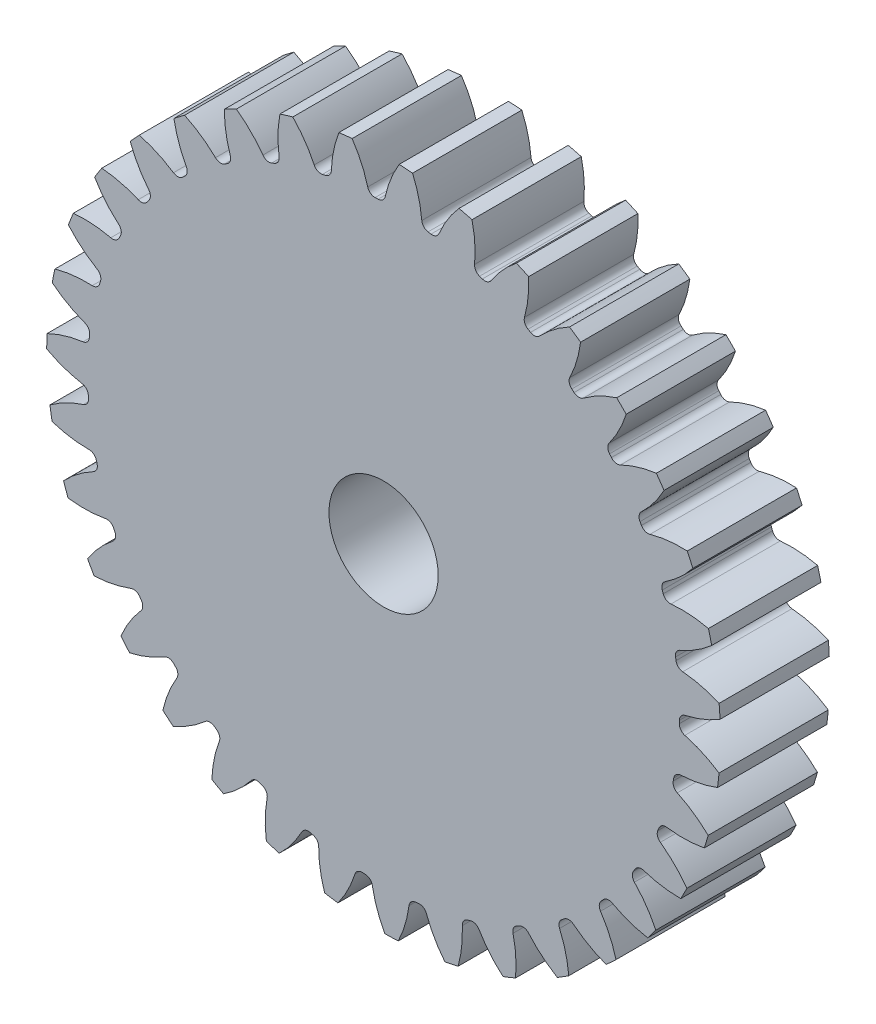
from build123d import *

# Parameters (mm, degrees)
SKETCH3_R         = 313.266666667
GEARBODY_DEPTH    = 101.6
TOOTHCUT_DEPTH    = 455.526752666
CIRPATTERN1_COUNT = 35
BOREDIA_R         = 50.8
BORE_DEPTH        = 12700


with BuildPart() as part:
    # Sketch3 → gearBody (new body)
    with BuildSketch(Plane.XY):
        Circle(SKETCH3_R)
    extrude(amount=GEARBODY_DEPTH)

    # Sketch2 → toothCut (cut, through all)
    with BuildSketch(Plane.XY):
        with BuildLine():
            ThreePointArc((275.071157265, -7.249336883), (275.104210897, -5.862387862), (275.130271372, -4.475289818))
            ThreePointArc((275.130271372, -4.475289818), (276.679491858, -0.232645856), (280.522964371, 2.139659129))
            ThreePointArc((280.522964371, 2.139659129), (297.44637759, 7.413405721), (313.266666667, 15.409202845))
            ThreePointArc((313.266666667, 15.409202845), (313.574228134, -6.68217234), (312.325852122, -28.740390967))
            ThreePointArc((312.325852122, -28.740390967), (296.860545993, -20.077907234), (280.177157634, -14.088009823))
            ThreePointArc((280.177157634, -14.088009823), (276.43823452, -11.554126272), (275.071157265, -7.249336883))
        make_face()
    toothcut = extrude(amount=TOOTHCUT_DEPTH, mode=Mode.SUBTRACT)

    # CirPattern1: toothCut ×35 about axis
    cirpattern1_axis = Axis((0, 0, 0), (0, 0, 1))
    for i in range(1, CIRPATTERN1_COUNT):
        add(toothcut.rotate(cirpattern1_axis, i * 360 / CIRPATTERN1_COUNT), mode=Mode.SUBTRACT)

    # boreDia → bore (cut, symmetric)
    with BuildSketch(Plane.XY):
        Circle(BOREDIA_R)
    extrude(amount=BORE_DEPTH, both=True, mode=Mode.SUBTRACT)


solid = part.part
